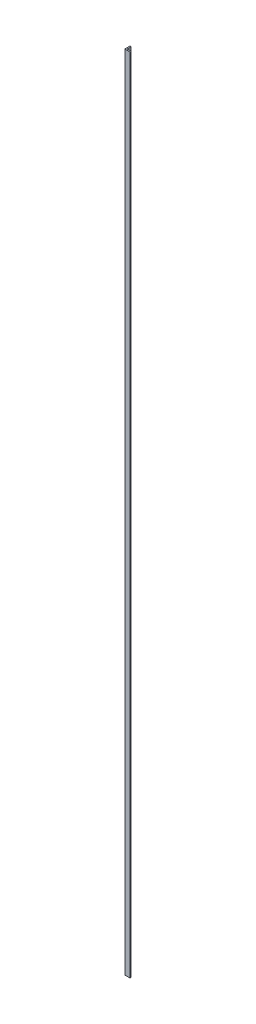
ISO-10303-21;
HEADER;
FILE_DESCRIPTION(('STEP AP214'),'2;1');
FILE_NAME('part.step','',(''),(''),'','','');
FILE_SCHEMA(('AUTOMOTIVE_DESIGN { 1 0 10303 214 1 1 1 1 }'));
ENDSEC;
DATA;
#1=APPLICATION_CONTEXT('core data for automotive mechanical design processes');
#2=APPLICATION_PROTOCOL_DEFINITION('international standard','automotive_design',2000,#1);
#3=PRODUCT_CONTEXT('',#1,'mechanical');
#4=PRODUCT('Part','Part','',(#3));
#5=PRODUCT_RELATED_PRODUCT_CATEGORY('part','',(#4));
#6=PRODUCT_DEFINITION_FORMATION('','',#4);
#7=PRODUCT_DEFINITION_CONTEXT('part definition',#1,'design');
#8=PRODUCT_DEFINITION('design','',#6,#7);
#9=PRODUCT_DEFINITION_SHAPE('','',#8);
#10=(LENGTH_UNIT() NAMED_UNIT(*) SI_UNIT(.MILLI.,.METRE.));
#11=(NAMED_UNIT(*) PLANE_ANGLE_UNIT() SI_UNIT($,.RADIAN.));
#12=(NAMED_UNIT(*) SI_UNIT($,.STERADIAN.) SOLID_ANGLE_UNIT());
#13=UNCERTAINTY_MEASURE_WITH_UNIT(LENGTH_MEASURE(1.E-05),#10,'distance_accuracy_value','');
#14=(GEOMETRIC_REPRESENTATION_CONTEXT(3) GLOBAL_UNCERTAINTY_ASSIGNED_CONTEXT((#13)) GLOBAL_UNIT_ASSIGNED_CONTEXT((#10,
#11,#12)) REPRESENTATION_CONTEXT('',''));
#15=CARTESIAN_POINT('',(0.,0.,0.));
#16=DIRECTION('',(0.,0.,1.));
#17=DIRECTION('',(1.,0.,0.));
#18=AXIS2_PLACEMENT_3D('',#15,#16,#17);
#19=CARTESIAN_POINT('',(3.,2017.,-13.));
#20=DIRECTION('',(0.,0.,1.));
#21=DIRECTION('',(1.,0.,0.));
#22=AXIS2_PLACEMENT_3D('',#19,#20,#21);
#23=PLANE('',#22);
#24=DIRECTION('',(-1.,0.,0.));
#25=VECTOR('',#24,1.);
#26=CARTESIAN_POINT('',(3.,0.,-13.));
#27=LINE('',#26,#25);
#28=CARTESIAN_POINT('',(3.,0.,-13.));
#29=VERTEX_POINT('',#28);
#30=CARTESIAN_POINT('',(0.,0.,-13.));
#31=VERTEX_POINT('',#30);
#32=EDGE_CURVE('E125',#29,#31,#27,.T.);
#33=ORIENTED_EDGE('',*,*,#32,.T.);
#34=DIRECTION('',(0.,-1.,0.));
#35=VECTOR('',#34,1.);
#36=CARTESIAN_POINT('',(0.,2017.,-13.));
#37=LINE('',#36,#35);
#38=CARTESIAN_POINT('',(0.,2017.,-13.));
#39=VERTEX_POINT('',#38);
#40=EDGE_CURVE('E11',#39,#31,#37,.T.);
#41=ORIENTED_EDGE('',*,*,#40,.F.);
#42=DIRECTION('',(-1.,0.,0.));
#43=VECTOR('',#42,1.);
#44=CARTESIAN_POINT('',(3.,2017.,-13.));
#45=LINE('',#44,#43);
#46=CARTESIAN_POINT('',(3.,2017.,-13.));
#47=VERTEX_POINT('',#46);
#48=EDGE_CURVE('E137',#47,#39,#45,.T.);
#49=ORIENTED_EDGE('',*,*,#48,.F.);
#50=DIRECTION('',(0.,-1.,0.));
#51=VECTOR('',#50,1.);
#52=CARTESIAN_POINT('',(3.,2017.,-13.));
#53=LINE('',#52,#51);
#54=EDGE_CURVE('E121',#47,#29,#53,.T.);
#55=ORIENTED_EDGE('',*,*,#54,.T.);
#56=EDGE_LOOP('',(#33,#41,#49,#55));
#57=FACE_BOUND('',#56,.T.);
#58=ADVANCED_FACE('F35',(#57),#23,.F.);
#59=CARTESIAN_POINT('',(0.,2017.,-13.));
#60=DIRECTION('',(1.,0.,0.));
#61=DIRECTION('',(0.,0.,-1.));
#62=AXIS2_PLACEMENT_3D('',#59,#60,#61);
#63=PLANE('',#62);
#64=DIRECTION('',(0.,0.,1.));
#65=VECTOR('',#64,1.);
#66=CARTESIAN_POINT('',(0.,0.,-13.));
#67=LINE('',#66,#65);
#68=CARTESIAN_POINT('',(0.,0.,0.));
#69=VERTEX_POINT('',#68);
#70=EDGE_CURVE('E128',#31,#69,#67,.T.);
#71=ORIENTED_EDGE('',*,*,#70,.T.);
#72=DIRECTION('',(0.,-1.,0.));
#73=VECTOR('',#72,1.);
#74=CARTESIAN_POINT('',(0.,2017.,0.));
#75=LINE('',#74,#73);
#76=CARTESIAN_POINT('',(0.,2017.,0.));
#77=VERTEX_POINT('',#76);
#78=EDGE_CURVE('E43',#77,#69,#75,.T.);
#79=ORIENTED_EDGE('',*,*,#78,.F.);
#80=DIRECTION('',(0.,0.,1.));
#81=VECTOR('',#80,1.);
#82=CARTESIAN_POINT('',(0.,2017.,-13.));
#83=LINE('',#82,#81);
#84=EDGE_CURVE('E91',#39,#77,#83,.T.);
#85=ORIENTED_EDGE('',*,*,#84,.F.);
#86=ORIENTED_EDGE('',*,*,#40,.T.);
#87=EDGE_LOOP('',(#71,#79,#85,#86));
#88=FACE_BOUND('',#87,.T.);
#89=ADVANCED_FACE('F162',(#88),#63,.F.);
#90=CARTESIAN_POINT('',(0.,2017.,0.));
#91=DIRECTION('',(0.,0.,-1.));
#92=DIRECTION('',(-1.,0.,0.));
#93=AXIS2_PLACEMENT_3D('',#90,#91,#92);
#94=PLANE('',#93);
#95=DIRECTION('',(1.,0.,0.));
#96=VECTOR('',#95,1.);
#97=CARTESIAN_POINT('',(0.,0.,0.));
#98=LINE('',#97,#96);
#99=CARTESIAN_POINT('',(13.,0.,0.));
#100=VERTEX_POINT('',#99);
#101=EDGE_CURVE('E130',#69,#100,#98,.T.);
#102=ORIENTED_EDGE('',*,*,#101,.T.);
#103=DIRECTION('',(0.,-1.,0.));
#104=VECTOR('',#103,1.);
#105=CARTESIAN_POINT('',(13.,2017.,0.));
#106=LINE('',#105,#104);
#107=CARTESIAN_POINT('',(13.,2017.,0.));
#108=VERTEX_POINT('',#107);
#109=EDGE_CURVE('E141',#108,#100,#106,.T.);
#110=ORIENTED_EDGE('',*,*,#109,.F.);
#111=DIRECTION('',(1.,0.,0.));
#112=VECTOR('',#111,1.);
#113=CARTESIAN_POINT('',(0.,2017.,0.));
#114=LINE('',#113,#112);
#115=EDGE_CURVE('E149',#77,#108,#114,.T.);
#116=ORIENTED_EDGE('',*,*,#115,.F.);
#117=ORIENTED_EDGE('',*,*,#78,.T.);
#118=EDGE_LOOP('',(#102,#110,#116,#117));
#119=FACE_BOUND('',#118,.T.);
#120=ADVANCED_FACE('F147',(#119),#94,.F.);
#121=CARTESIAN_POINT('',(13.,2017.,0.));
#122=DIRECTION('',(-1.,0.,0.));
#123=DIRECTION('',(0.,0.,1.));
#124=AXIS2_PLACEMENT_3D('',#121,#122,#123);
#125=PLANE('',#124);
#126=DIRECTION('',(0.,0.,-1.));
#127=VECTOR('',#126,1.);
#128=CARTESIAN_POINT('',(13.,0.,0.));
#129=LINE('',#128,#127);
#130=CARTESIAN_POINT('',(13.,0.,-3.));
#131=VERTEX_POINT('',#130);
#132=EDGE_CURVE('E132',#100,#131,#129,.T.);
#133=ORIENTED_EDGE('',*,*,#132,.T.);
#134=DIRECTION('',(0.,-1.,0.));
#135=VECTOR('',#134,1.);
#136=CARTESIAN_POINT('',(13.,2017.,-3.));
#137=LINE('',#136,#135);
#138=CARTESIAN_POINT('',(13.,2017.,-3.));
#139=VERTEX_POINT('',#138);
#140=EDGE_CURVE('E116',#139,#131,#137,.T.);
#141=ORIENTED_EDGE('',*,*,#140,.F.);
#142=DIRECTION('',(0.,0.,-1.));
#143=VECTOR('',#142,1.);
#144=CARTESIAN_POINT('',(13.,2017.,0.));
#145=LINE('',#144,#143);
#146=EDGE_CURVE('E107',#108,#139,#145,.T.);
#147=ORIENTED_EDGE('',*,*,#146,.F.);
#148=ORIENTED_EDGE('',*,*,#109,.T.);
#149=EDGE_LOOP('',(#133,#141,#147,#148));
#150=FACE_BOUND('',#149,.T.);
#151=ADVANCED_FACE('F155',(#150),#125,.F.);
#152=CARTESIAN_POINT('',(13.,2017.,-3.));
#153=DIRECTION('',(0.,0.,1.));
#154=DIRECTION('',(1.,0.,0.));
#155=AXIS2_PLACEMENT_3D('',#152,#153,#154);
#156=PLANE('',#155);
#157=DIRECTION('',(-1.,0.,0.));
#158=VECTOR('',#157,1.);
#159=CARTESIAN_POINT('',(13.,0.,-3.));
#160=LINE('',#159,#158);
#161=CARTESIAN_POINT('',(4.5,0.,-3.));
#162=VERTEX_POINT('',#161);
#163=EDGE_CURVE('E115',#131,#162,#160,.T.);
#164=ORIENTED_EDGE('',*,*,#163,.T.);
#165=DIRECTION('',(0.,-1.,0.));
#166=VECTOR('',#165,1.);
#167=CARTESIAN_POINT('',(4.5,2017.,-3.));
#168=LINE('',#167,#166);
#169=CARTESIAN_POINT('',(4.5,2017.,-3.));
#170=VERTEX_POINT('',#169);
#171=EDGE_CURVE('E112',#170,#162,#168,.T.);
#172=ORIENTED_EDGE('',*,*,#171,.F.);
#173=DIRECTION('',(-1.,0.,0.));
#174=VECTOR('',#173,1.);
#175=CARTESIAN_POINT('',(13.,2017.,-3.));
#176=LINE('',#175,#174);
#177=EDGE_CURVE('E101',#139,#170,#176,.T.);
#178=ORIENTED_EDGE('',*,*,#177,.F.);
#179=ORIENTED_EDGE('',*,*,#140,.T.);
#180=EDGE_LOOP('',(#164,#172,#178,#179));
#181=FACE_BOUND('',#180,.T.);
#182=ADVANCED_FACE('F113',(#181),#156,.F.);
#183=CARTESIAN_POINT('',(4.5,2017.,-4.5));
#184=DIRECTION('',(0.,-1.,0.));
#185=DIRECTION('',(0.,0.,-1.));
#186=AXIS2_PLACEMENT_3D('',#183,#184,#185);
#187=CYLINDRICAL_SURFACE('',#186,1.5);
#188=CARTESIAN_POINT('',(4.5,0.,-4.5));
#189=DIRECTION('',(0.,-1.,0.));
#190=DIRECTION('',(0.,0.,-1.));
#191=AXIS2_PLACEMENT_3D('',#188,#189,#190);
#192=CIRCLE('',#191,1.5);
#193=CARTESIAN_POINT('',(3.,0.,-4.5));
#194=VERTEX_POINT('',#193);
#195=EDGE_CURVE('E77',#162,#194,#192,.T.);
#196=ORIENTED_EDGE('',*,*,#195,.T.);
#197=DIRECTION('',(0.,-1.,0.));
#198=VECTOR('',#197,1.);
#199=CARTESIAN_POINT('',(3.,2017.,-4.5));
#200=LINE('',#199,#198);
#201=CARTESIAN_POINT('',(3.,2017.,-4.5));
#202=VERTEX_POINT('',#201);
#203=EDGE_CURVE('E117',#202,#194,#200,.T.);
#204=ORIENTED_EDGE('',*,*,#203,.F.);
#205=CARTESIAN_POINT('',(4.5,2017.,-4.5));
#206=DIRECTION('',(0.,-1.,0.));
#207=DIRECTION('',(0.,0.,-1.));
#208=AXIS2_PLACEMENT_3D('',#205,#206,#207);
#209=CIRCLE('',#208,1.5);
#210=EDGE_CURVE('E105',#170,#202,#209,.T.);
#211=ORIENTED_EDGE('',*,*,#210,.F.);
#212=ORIENTED_EDGE('',*,*,#171,.T.);
#213=EDGE_LOOP('',(#196,#204,#211,#212));
#214=FACE_BOUND('',#213,.T.);
#215=ADVANCED_FACE('F119',(#214),#187,.F.);
#216=CARTESIAN_POINT('',(3.,2017.,-4.5));
#217=DIRECTION('',(-1.,0.,0.));
#218=DIRECTION('',(0.,0.,1.));
#219=AXIS2_PLACEMENT_3D('',#216,#217,#218);
#220=PLANE('',#219);
#221=DIRECTION('',(0.,0.,-1.));
#222=VECTOR('',#221,1.);
#223=CARTESIAN_POINT('',(3.,0.,-4.5));
#224=LINE('',#223,#222);
#225=EDGE_CURVE('E83',#194,#29,#224,.T.);
#226=ORIENTED_EDGE('',*,*,#225,.T.);
#227=ORIENTED_EDGE('',*,*,#54,.F.);
#228=DIRECTION('',(0.,0.,-1.));
#229=VECTOR('',#228,1.);
#230=CARTESIAN_POINT('',(3.,2017.,-4.5));
#231=LINE('',#230,#229);
#232=EDGE_CURVE('E51',#202,#47,#231,.T.);
#233=ORIENTED_EDGE('',*,*,#232,.F.);
#234=ORIENTED_EDGE('',*,*,#203,.T.);
#235=EDGE_LOOP('',(#226,#227,#233,#234));
#236=FACE_BOUND('',#235,.T.);
#237=ADVANCED_FACE('F176',(#236),#220,.F.);
#238=CARTESIAN_POINT('',(4.5,2017.,-4.5));
#239=DIRECTION('',(0.,-1.,0.));
#240=DIRECTION('',(0.,0.,-1.));
#241=AXIS2_PLACEMENT_3D('',#238,#239,#240);
#242=PLANE('',#241);
#243=ORIENTED_EDGE('',*,*,#48,.T.);
#244=ORIENTED_EDGE('',*,*,#84,.T.);
#245=ORIENTED_EDGE('',*,*,#115,.T.);
#246=ORIENTED_EDGE('',*,*,#146,.T.);
#247=ORIENTED_EDGE('',*,*,#177,.T.);
#248=ORIENTED_EDGE('',*,*,#210,.T.);
#249=ORIENTED_EDGE('',*,*,#232,.T.);
#250=EDGE_LOOP('',(#243,#244,#245,#246,#247,#248,#249));
#251=FACE_BOUND('',#250,.T.);
#252=ADVANCED_FACE('F103',(#251),#242,.F.);
#253=CARTESIAN_POINT('',(4.5,0.,-4.5));
#254=DIRECTION('',(0.,-1.,0.));
#255=DIRECTION('',(0.,0.,-1.));
#256=AXIS2_PLACEMENT_3D('',#253,#254,#255);
#257=PLANE('',#256);
#258=ORIENTED_EDGE('',*,*,#32,.F.);
#259=ORIENTED_EDGE('',*,*,#225,.F.);
#260=ORIENTED_EDGE('',*,*,#195,.F.);
#261=ORIENTED_EDGE('',*,*,#163,.F.);
#262=ORIENTED_EDGE('',*,*,#132,.F.);
#263=ORIENTED_EDGE('',*,*,#101,.F.);
#264=ORIENTED_EDGE('',*,*,#70,.F.);
#265=EDGE_LOOP('',(#258,#259,#260,#261,#262,#263,#264));
#266=FACE_BOUND('',#265,.T.);
#267=ADVANCED_FACE('F153',(#266),#257,.T.);
#268=CLOSED_SHELL('',(#58,#89,#120,#151,#182,#215,#237,#252,#267));
#269=MANIFOLD_SOLID_BREP('B2',#268);
#270=ADVANCED_BREP_SHAPE_REPRESENTATION('',(#18,#269),#14);
#271=SHAPE_DEFINITION_REPRESENTATION(#9,#270);
ENDSEC;
END-ISO-10303-21;
